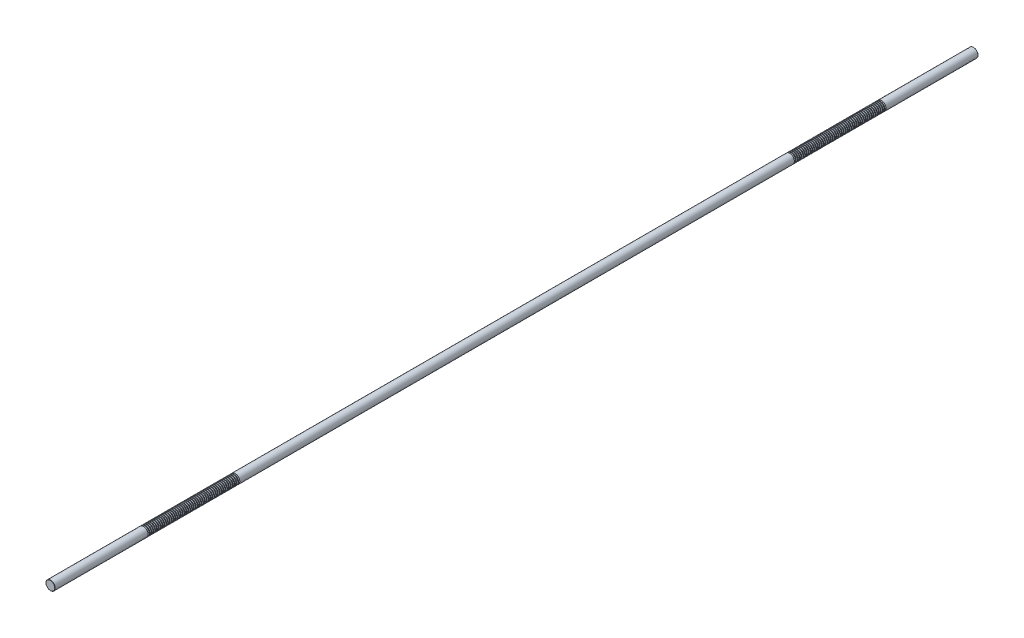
from build123d import *

# Parameters (mm, degrees)
SKETCH1_R           = 5
BOSS_EXTRUDE1_DEPTH = 500
CHAMFER1_SIZE       = 0.25
LPATTERN1_COUNT     = 50
LPATTERN1_PITCH     = 2
LPATTERN2_COUNT     = 2
LPATTERN2_PITCH     = 700


with BuildPart() as part:
    # Sketch1 → Boss-Extrude1 (new, symmetric)
    with BuildSketch(Plane.XY):
        Circle(SKETCH1_R)
    extrude(amount=BOSS_EXTRUDE1_DEPTH, both=True)

    # Chamfer1
    chamfer1_edges = [part.edges().sort_by_distance(p)[0] for p in [
        (-5, 0, -500),
        (-5, 0, 500),
    ]]
    chamfer(chamfer1_edges, length=CHAMFER1_SIZE)

    # Sketch2 → Cut-Revolve1 (revolve, cut)
    with BuildSketch(Plane(origin=(0, 0, 0), x_dir=(0, 0, -1), z_dir=(1, 0, 0)), mode=Mode.PRIVATE) as cut_revolve1_sk:
        Polygon((400.167468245, 5), (398.832531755, 5), (399.167468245, 3.75), (399.832531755, 3.75), align=None)
    cut_revolve1 = revolve(cut_revolve1_sk.sketch.rotate(Axis((0, 0, 500), (0, 0, -1)), 90), axis=Axis((0, 0, 500), (0, 0, -1)), mode=Mode.SUBTRACT)

    # LPattern1: Cut-Revolve1 ×50
    with Locations(*[(0, 0, i * LPATTERN1_PITCH) for i in range(1, LPATTERN1_COUNT)]):
        add(cut_revolve1, mode=Mode.SUBTRACT)

    # LPattern2: Cut-Revolve1 ×2
    with Locations(*[(0, 0, i * LPATTERN2_PITCH) for i in range(1, LPATTERN2_COUNT)]):
        add(cut_revolve1, mode=Mode.SUBTRACT)

    # LPattern2 copy 1 sketch → LPattern2 copy 1 (revolve, cut)
    with BuildSketch(Plane(origin=(0, 0, 702), x_dir=(0, 0, -1), z_dir=(1, 0, 0))):
        Polygon((400.167468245, 5), (398.832531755, 5), (399.167468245, 3.75), (399.832531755, 3.75), align=None)
    revolve(axis=Axis((0, 0, 1202), (0, 0, -1)), mode=Mode.SUBTRACT)

    # LPattern2 copy 2 sketch → LPattern2 copy 2 (revolve, cut)
    with BuildSketch(Plane(origin=(0, 0, 704), x_dir=(0, 0, -1), z_dir=(1, 0, 0))):
        Polygon((400.167468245, 5), (398.832531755, 5), (399.167468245, 3.75), (399.832531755, 3.75), align=None)
    revolve(axis=Axis((0, 0, 1204), (0, 0, -1)), mode=Mode.SUBTRACT)

    # LPattern2 copy 3 sketch → LPattern2 copy 3 (revolve, cut)
    with BuildSketch(Plane(origin=(0, 0, 706), x_dir=(0, 0, -1), z_dir=(1, 0, 0))):
        Polygon((400.167468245, 5), (398.832531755, 5), (399.167468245, 3.75), (399.832531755, 3.75), align=None)
    revolve(axis=Axis((0, 0, 1206), (0, 0, -1)), mode=Mode.SUBTRACT)

    # LPattern2 copy 4 sketch → LPattern2 copy 4 (revolve, cut)
    with BuildSketch(Plane(origin=(0, 0, 708), x_dir=(0, 0, -1), z_dir=(1, 0, 0))):
        Polygon((400.167468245, 5), (398.832531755, 5), (399.167468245, 3.75), (399.832531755, 3.75), align=None)
    revolve(axis=Axis((0, 0, 1208), (0, 0, -1)), mode=Mode.SUBTRACT)

    # LPattern2 copy 5 sketch → LPattern2 copy 5 (revolve, cut)
    with BuildSketch(Plane(origin=(0, 0, 710), x_dir=(0, 0, -1), z_dir=(1, 0, 0))):
        Polygon((400.167468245, 5), (398.832531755, 5), (399.167468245, 3.75), (399.832531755, 3.75), align=None)
    revolve(axis=Axis((0, 0, 1210), (0, 0, -1)), mode=Mode.SUBTRACT)

    # LPattern2 copy 6 sketch → LPattern2 copy 6 (revolve, cut)
    with BuildSketch(Plane(origin=(0, 0, 712), x_dir=(0, 0, -1), z_dir=(1, 0, 0))):
        Polygon((400.167468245, 5), (398.832531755, 5), (399.167468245, 3.75), (399.832531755, 3.75), align=None)
    revolve(axis=Axis((0, 0, 1212), (0, 0, -1)), mode=Mode.SUBTRACT)

    # LPattern2 copy 7 sketch → LPattern2 copy 7 (revolve, cut)
    with BuildSketch(Plane(origin=(0, 0, 714), x_dir=(0, 0, -1), z_dir=(1, 0, 0))):
        Polygon((400.167468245, 5), (398.832531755, 5), (399.167468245, 3.75), (399.832531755, 3.75), align=None)
    revolve(axis=Axis((0, 0, 1214), (0, 0, -1)), mode=Mode.SUBTRACT)

    # LPattern2 copy 8 sketch → LPattern2 copy 8 (revolve, cut)
    with BuildSketch(Plane(origin=(0, 0, 716), x_dir=(0, 0, -1), z_dir=(1, 0, 0))):
        Polygon((400.167468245, 5), (398.832531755, 5), (399.167468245, 3.75), (399.832531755, 3.75), align=None)
    revolve(axis=Axis((0, 0, 1216), (0, 0, -1)), mode=Mode.SUBTRACT)

    # LPattern2 copy 9 sketch → LPattern2 copy 9 (revolve, cut)
    with BuildSketch(Plane(origin=(0, 0, 718), x_dir=(0, 0, -1), z_dir=(1, 0, 0))):
        Polygon((400.167468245, 5), (398.832531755, 5), (399.167468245, 3.75), (399.832531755, 3.75), align=None)
    revolve(axis=Axis((0, 0, 1218), (0, 0, -1)), mode=Mode.SUBTRACT)

    # LPattern2 copy 10 sketch → LPattern2 copy 10 (revolve, cut)
    with BuildSketch(Plane(origin=(0, 0, 720), x_dir=(0, 0, -1), z_dir=(1, 0, 0))):
        Polygon((400.167468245, 5), (398.832531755, 5), (399.167468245, 3.75), (399.832531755, 3.75), align=None)
    revolve(axis=Axis((0, 0, 1220), (0, 0, -1)), mode=Mode.SUBTRACT)

    # LPattern2 copy 11 sketch → LPattern2 copy 11 (revolve, cut)
    with BuildSketch(Plane(origin=(0, 0, 722), x_dir=(0, 0, -1), z_dir=(1, 0, 0))):
        Polygon((400.167468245, 5), (398.832531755, 5), (399.167468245, 3.75), (399.832531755, 3.75), align=None)
    revolve(axis=Axis((0, 0, 1222), (0, 0, -1)), mode=Mode.SUBTRACT)

    # LPattern2 copy 12 sketch → LPattern2 copy 12 (revolve, cut)
    with BuildSketch(Plane(origin=(0, 0, 724), x_dir=(0, 0, -1), z_dir=(1, 0, 0))):
        Polygon((400.167468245, 5), (398.832531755, 5), (399.167468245, 3.75), (399.832531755, 3.75), align=None)
    revolve(axis=Axis((0, 0, 1224), (0, 0, -1)), mode=Mode.SUBTRACT)

    # LPattern2 copy 13 sketch → LPattern2 copy 13 (revolve, cut)
    with BuildSketch(Plane(origin=(0, 0, 726), x_dir=(0, 0, -1), z_dir=(1, 0, 0))):
        Polygon((400.167468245, 5), (398.832531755, 5), (399.167468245, 3.75), (399.832531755, 3.75), align=None)
    revolve(axis=Axis((0, 0, 1226), (0, 0, -1)), mode=Mode.SUBTRACT)

    # LPattern2 copy 14 sketch → LPattern2 copy 14 (revolve, cut)
    with BuildSketch(Plane(origin=(0, 0, 728), x_dir=(0, 0, -1), z_dir=(1, 0, 0))):
        Polygon((400.167468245, 5), (398.832531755, 5), (399.167468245, 3.75), (399.832531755, 3.75), align=None)
    revolve(axis=Axis((0, 0, 1228), (0, 0, -1)), mode=Mode.SUBTRACT)

    # LPattern2 copy 15 sketch → LPattern2 copy 15 (revolve, cut)
    with BuildSketch(Plane(origin=(0, 0, 730), x_dir=(0, 0, -1), z_dir=(1, 0, 0))):
        Polygon((400.167468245, 5), (398.832531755, 5), (399.167468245, 3.75), (399.832531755, 3.75), align=None)
    revolve(axis=Axis((0, 0, 1230), (0, 0, -1)), mode=Mode.SUBTRACT)

    # LPattern2 copy 16 sketch → LPattern2 copy 16 (revolve, cut)
    with BuildSketch(Plane(origin=(0, 0, 732), x_dir=(0, 0, -1), z_dir=(1, 0, 0))):
        Polygon((400.167468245, 5), (398.832531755, 5), (399.167468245, 3.75), (399.832531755, 3.75), align=None)
    revolve(axis=Axis((0, 0, 1232), (0, 0, -1)), mode=Mode.SUBTRACT)

    # LPattern2 copy 17 sketch → LPattern2 copy 17 (revolve, cut)
    with BuildSketch(Plane(origin=(0, 0, 734), x_dir=(0, 0, -1), z_dir=(1, 0, 0))):
        Polygon((400.167468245, 5), (398.832531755, 5), (399.167468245, 3.75), (399.832531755, 3.75), align=None)
    revolve(axis=Axis((0, 0, 1234), (0, 0, -1)), mode=Mode.SUBTRACT)

    # LPattern2 copy 18 sketch → LPattern2 copy 18 (revolve, cut)
    with BuildSketch(Plane(origin=(0, 0, 736), x_dir=(0, 0, -1), z_dir=(1, 0, 0))):
        Polygon((400.167468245, 5), (398.832531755, 5), (399.167468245, 3.75), (399.832531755, 3.75), align=None)
    revolve(axis=Axis((0, 0, 1236), (0, 0, -1)), mode=Mode.SUBTRACT)

    # LPattern2 copy 19 sketch → LPattern2 copy 19 (revolve, cut)
    with BuildSketch(Plane(origin=(0, 0, 738), x_dir=(0, 0, -1), z_dir=(1, 0, 0))):
        Polygon((400.167468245, 5), (398.832531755, 5), (399.167468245, 3.75), (399.832531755, 3.75), align=None)
    revolve(axis=Axis((0, 0, 1238), (0, 0, -1)), mode=Mode.SUBTRACT)

    # LPattern2 copy 20 sketch → LPattern2 copy 20 (revolve, cut)
    with BuildSketch(Plane(origin=(0, 0, 740), x_dir=(0, 0, -1), z_dir=(1, 0, 0))):
        Polygon((400.167468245, 5), (398.832531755, 5), (399.167468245, 3.75), (399.832531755, 3.75), align=None)
    revolve(axis=Axis((0, 0, 1240), (0, 0, -1)), mode=Mode.SUBTRACT)

    # LPattern2 copy 21 sketch → LPattern2 copy 21 (revolve, cut)
    with BuildSketch(Plane(origin=(0, 0, 742), x_dir=(0, 0, -1), z_dir=(1, 0, 0))):
        Polygon((400.167468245, 5), (398.832531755, 5), (399.167468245, 3.75), (399.832531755, 3.75), align=None)
    revolve(axis=Axis((0, 0, 1242), (0, 0, -1)), mode=Mode.SUBTRACT)

    # LPattern2 copy 22 sketch → LPattern2 copy 22 (revolve, cut)
    with BuildSketch(Plane(origin=(0, 0, 744), x_dir=(0, 0, -1), z_dir=(1, 0, 0))):
        Polygon((400.167468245, 5), (398.832531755, 5), (399.167468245, 3.75), (399.832531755, 3.75), align=None)
    revolve(axis=Axis((0, 0, 1244), (0, 0, -1)), mode=Mode.SUBTRACT)

    # LPattern2 copy 23 sketch → LPattern2 copy 23 (revolve, cut)
    with BuildSketch(Plane(origin=(0, 0, 746), x_dir=(0, 0, -1), z_dir=(1, 0, 0))):
        Polygon((400.167468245, 5), (398.832531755, 5), (399.167468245, 3.75), (399.832531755, 3.75), align=None)
    revolve(axis=Axis((0, 0, 1246), (0, 0, -1)), mode=Mode.SUBTRACT)

    # LPattern2 copy 24 sketch → LPattern2 copy 24 (revolve, cut)
    with BuildSketch(Plane(origin=(0, 0, 748), x_dir=(0, 0, -1), z_dir=(1, 0, 0))):
        Polygon((400.167468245, 5), (398.832531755, 5), (399.167468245, 3.75), (399.832531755, 3.75), align=None)
    revolve(axis=Axis((0, 0, 1248), (0, 0, -1)), mode=Mode.SUBTRACT)

    # LPattern2 copy 25 sketch → LPattern2 copy 25 (revolve, cut)
    with BuildSketch(Plane(origin=(0, 0, 750), x_dir=(0, 0, -1), z_dir=(1, 0, 0))):
        Polygon((400.167468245, 5), (398.832531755, 5), (399.167468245, 3.75), (399.832531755, 3.75), align=None)
    revolve(axis=Axis((0, 0, 1250), (0, 0, -1)), mode=Mode.SUBTRACT)

    # LPattern2 copy 26 sketch → LPattern2 copy 26 (revolve, cut)
    with BuildSketch(Plane(origin=(0, 0, 752), x_dir=(0, 0, -1), z_dir=(1, 0, 0))):
        Polygon((400.167468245, 5), (398.832531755, 5), (399.167468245, 3.75), (399.832531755, 3.75), align=None)
    revolve(axis=Axis((0, 0, 1252), (0, 0, -1)), mode=Mode.SUBTRACT)

    # LPattern2 copy 27 sketch → LPattern2 copy 27 (revolve, cut)
    with BuildSketch(Plane(origin=(0, 0, 754), x_dir=(0, 0, -1), z_dir=(1, 0, 0))):
        Polygon((400.167468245, 5), (398.832531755, 5), (399.167468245, 3.75), (399.832531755, 3.75), align=None)
    revolve(axis=Axis((0, 0, 1254), (0, 0, -1)), mode=Mode.SUBTRACT)

    # LPattern2 copy 28 sketch → LPattern2 copy 28 (revolve, cut)
    with BuildSketch(Plane(origin=(0, 0, 756), x_dir=(0, 0, -1), z_dir=(1, 0, 0))):
        Polygon((400.167468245, 5), (398.832531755, 5), (399.167468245, 3.75), (399.832531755, 3.75), align=None)
    revolve(axis=Axis((0, 0, 1256), (0, 0, -1)), mode=Mode.SUBTRACT)

    # LPattern2 copy 29 sketch → LPattern2 copy 29 (revolve, cut)
    with BuildSketch(Plane(origin=(0, 0, 758), x_dir=(0, 0, -1), z_dir=(1, 0, 0))):
        Polygon((400.167468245, 5), (398.832531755, 5), (399.167468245, 3.75), (399.832531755, 3.75), align=None)
    revolve(axis=Axis((0, 0, 1258), (0, 0, -1)), mode=Mode.SUBTRACT)

    # LPattern2 copy 30 sketch → LPattern2 copy 30 (revolve, cut)
    with BuildSketch(Plane(origin=(0, 0, 760), x_dir=(0, 0, -1), z_dir=(1, 0, 0))):
        Polygon((400.167468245, 5), (398.832531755, 5), (399.167468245, 3.75), (399.832531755, 3.75), align=None)
    revolve(axis=Axis((0, 0, 1260), (0, 0, -1)), mode=Mode.SUBTRACT)

    # LPattern2 copy 31 sketch → LPattern2 copy 31 (revolve, cut)
    with BuildSketch(Plane(origin=(0, 0, 762), x_dir=(0, 0, -1), z_dir=(1, 0, 0))):
        Polygon((400.167468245, 5), (398.832531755, 5), (399.167468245, 3.75), (399.832531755, 3.75), align=None)
    revolve(axis=Axis((0, 0, 1262), (0, 0, -1)), mode=Mode.SUBTRACT)

    # LPattern2 copy 32 sketch → LPattern2 copy 32 (revolve, cut)
    with BuildSketch(Plane(origin=(0, 0, 764), x_dir=(0, 0, -1), z_dir=(1, 0, 0))):
        Polygon((400.167468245, 5), (398.832531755, 5), (399.167468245, 3.75), (399.832531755, 3.75), align=None)
    revolve(axis=Axis((0, 0, 1264), (0, 0, -1)), mode=Mode.SUBTRACT)

    # LPattern2 copy 33 sketch → LPattern2 copy 33 (revolve, cut)
    with BuildSketch(Plane(origin=(0, 0, 766), x_dir=(0, 0, -1), z_dir=(1, 0, 0))):
        Polygon((400.167468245, 5), (398.832531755, 5), (399.167468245, 3.75), (399.832531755, 3.75), align=None)
    revolve(axis=Axis((0, 0, 1266), (0, 0, -1)), mode=Mode.SUBTRACT)

    # LPattern2 copy 34 sketch → LPattern2 copy 34 (revolve, cut)
    with BuildSketch(Plane(origin=(0, 0, 768), x_dir=(0, 0, -1), z_dir=(1, 0, 0))):
        Polygon((400.167468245, 5), (398.832531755, 5), (399.167468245, 3.75), (399.832531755, 3.75), align=None)
    revolve(axis=Axis((0, 0, 1268), (0, 0, -1)), mode=Mode.SUBTRACT)

    # LPattern2 copy 35 sketch → LPattern2 copy 35 (revolve, cut)
    with BuildSketch(Plane(origin=(0, 0, 770), x_dir=(0, 0, -1), z_dir=(1, 0, 0))):
        Polygon((400.167468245, 5), (398.832531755, 5), (399.167468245, 3.75), (399.832531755, 3.75), align=None)
    revolve(axis=Axis((0, 0, 1270), (0, 0, -1)), mode=Mode.SUBTRACT)

    # LPattern2 copy 36 sketch → LPattern2 copy 36 (revolve, cut)
    with BuildSketch(Plane(origin=(0, 0, 772), x_dir=(0, 0, -1), z_dir=(1, 0, 0))):
        Polygon((400.167468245, 5), (398.832531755, 5), (399.167468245, 3.75), (399.832531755, 3.75), align=None)
    revolve(axis=Axis((0, 0, 1272), (0, 0, -1)), mode=Mode.SUBTRACT)

    # LPattern2 copy 37 sketch → LPattern2 copy 37 (revolve, cut)
    with BuildSketch(Plane(origin=(0, 0, 774), x_dir=(0, 0, -1), z_dir=(1, 0, 0))):
        Polygon((400.167468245, 5), (398.832531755, 5), (399.167468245, 3.75), (399.832531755, 3.75), align=None)
    revolve(axis=Axis((0, 0, 1274), (0, 0, -1)), mode=Mode.SUBTRACT)

    # LPattern2 copy 38 sketch → LPattern2 copy 38 (revolve, cut)
    with BuildSketch(Plane(origin=(0, 0, 776), x_dir=(0, 0, -1), z_dir=(1, 0, 0))):
        Polygon((400.167468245, 5), (398.832531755, 5), (399.167468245, 3.75), (399.832531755, 3.75), align=None)
    revolve(axis=Axis((0, 0, 1276), (0, 0, -1)), mode=Mode.SUBTRACT)

    # LPattern2 copy 39 sketch → LPattern2 copy 39 (revolve, cut)
    with BuildSketch(Plane(origin=(0, 0, 778), x_dir=(0, 0, -1), z_dir=(1, 0, 0))):
        Polygon((400.167468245, 5), (398.832531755, 5), (399.167468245, 3.75), (399.832531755, 3.75), align=None)
    revolve(axis=Axis((0, 0, 1278), (0, 0, -1)), mode=Mode.SUBTRACT)

    # LPattern2 copy 40 sketch → LPattern2 copy 40 (revolve, cut)
    with BuildSketch(Plane(origin=(0, 0, 780), x_dir=(0, 0, -1), z_dir=(1, 0, 0))):
        Polygon((400.167468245, 5), (398.832531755, 5), (399.167468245, 3.75), (399.832531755, 3.75), align=None)
    revolve(axis=Axis((0, 0, 1280), (0, 0, -1)), mode=Mode.SUBTRACT)

    # LPattern2 copy 41 sketch → LPattern2 copy 41 (revolve, cut)
    with BuildSketch(Plane(origin=(0, 0, 782), x_dir=(0, 0, -1), z_dir=(1, 0, 0))):
        Polygon((400.167468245, 5), (398.832531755, 5), (399.167468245, 3.75), (399.832531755, 3.75), align=None)
    revolve(axis=Axis((0, 0, 1282), (0, 0, -1)), mode=Mode.SUBTRACT)

    # LPattern2 copy 42 sketch → LPattern2 copy 42 (revolve, cut)
    with BuildSketch(Plane(origin=(0, 0, 784), x_dir=(0, 0, -1), z_dir=(1, 0, 0))):
        Polygon((400.167468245, 5), (398.832531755, 5), (399.167468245, 3.75), (399.832531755, 3.75), align=None)
    revolve(axis=Axis((0, 0, 1284), (0, 0, -1)), mode=Mode.SUBTRACT)

    # LPattern2 copy 43 sketch → LPattern2 copy 43 (revolve, cut)
    with BuildSketch(Plane(origin=(0, 0, 786), x_dir=(0, 0, -1), z_dir=(1, 0, 0))):
        Polygon((400.167468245, 5), (398.832531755, 5), (399.167468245, 3.75), (399.832531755, 3.75), align=None)
    revolve(axis=Axis((0, 0, 1286), (0, 0, -1)), mode=Mode.SUBTRACT)

    # LPattern2 copy 44 sketch → LPattern2 copy 44 (revolve, cut)
    with BuildSketch(Plane(origin=(0, 0, 788), x_dir=(0, 0, -1), z_dir=(1, 0, 0))):
        Polygon((400.167468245, 5), (398.832531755, 5), (399.167468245, 3.75), (399.832531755, 3.75), align=None)
    revolve(axis=Axis((0, 0, 1288), (0, 0, -1)), mode=Mode.SUBTRACT)

    # LPattern2 copy 45 sketch → LPattern2 copy 45 (revolve, cut)
    with BuildSketch(Plane(origin=(0, 0, 790), x_dir=(0, 0, -1), z_dir=(1, 0, 0))):
        Polygon((400.167468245, 5), (398.832531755, 5), (399.167468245, 3.75), (399.832531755, 3.75), align=None)
    revolve(axis=Axis((0, 0, 1290), (0, 0, -1)), mode=Mode.SUBTRACT)

    # LPattern2 copy 46 sketch → LPattern2 copy 46 (revolve, cut)
    with BuildSketch(Plane(origin=(0, 0, 792), x_dir=(0, 0, -1), z_dir=(1, 0, 0))):
        Polygon((400.167468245, 5), (398.832531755, 5), (399.167468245, 3.75), (399.832531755, 3.75), align=None)
    revolve(axis=Axis((0, 0, 1292), (0, 0, -1)), mode=Mode.SUBTRACT)

    # LPattern2 copy 47 sketch → LPattern2 copy 47 (revolve, cut)
    with BuildSketch(Plane(origin=(0, 0, 794), x_dir=(0, 0, -1), z_dir=(1, 0, 0))):
        Polygon((400.167468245, 5), (398.832531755, 5), (399.167468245, 3.75), (399.832531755, 3.75), align=None)
    revolve(axis=Axis((0, 0, 1294), (0, 0, -1)), mode=Mode.SUBTRACT)

    # LPattern2 copy 48 sketch → LPattern2 copy 48 (revolve, cut)
    with BuildSketch(Plane(origin=(0, 0, 796), x_dir=(0, 0, -1), z_dir=(1, 0, 0))):
        Polygon((400.167468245, 5), (398.832531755, 5), (399.167468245, 3.75), (399.832531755, 3.75), align=None)
    revolve(axis=Axis((0, 0, 1296), (0, 0, -1)), mode=Mode.SUBTRACT)

    # LPattern2 copy 49 sketch → LPattern2 copy 49 (revolve, cut)
    with BuildSketch(Plane(origin=(0, 0, 798), x_dir=(0, 0, -1), z_dir=(1, 0, 0))):
        Polygon((400.167468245, 5), (398.832531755, 5), (399.167468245, 3.75), (399.832531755, 3.75), align=None)
    revolve(axis=Axis((0, 0, 1298), (0, 0, -1)), mode=Mode.SUBTRACT)


solid = part.part
